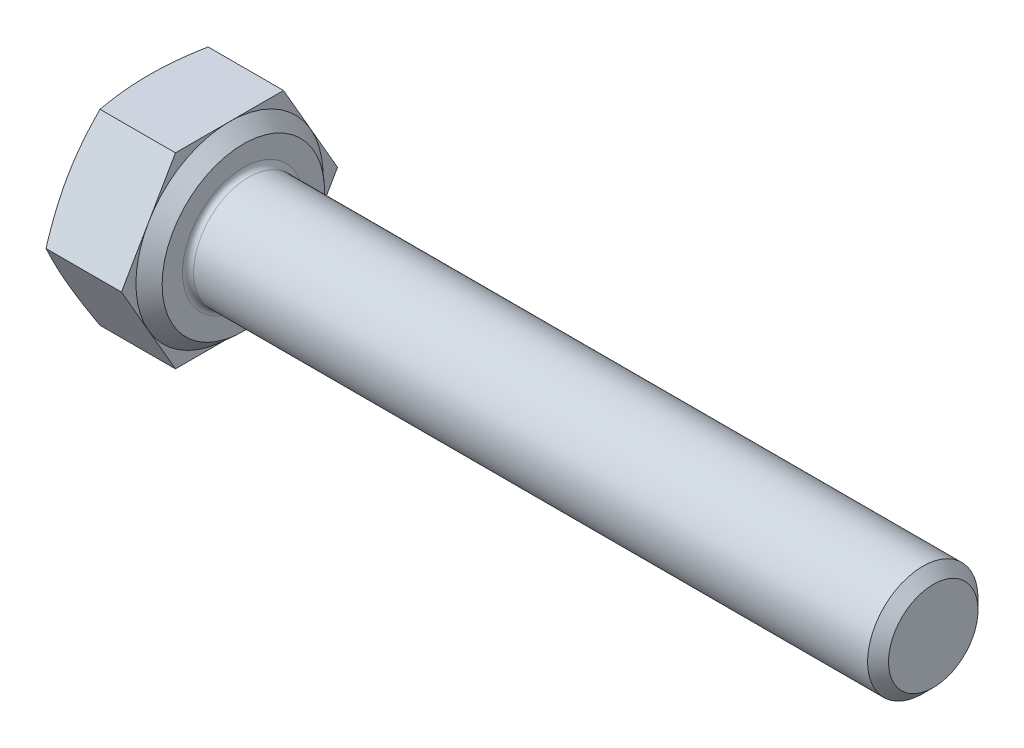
ISO-10303-21;
HEADER;
FILE_DESCRIPTION(('STEP AP214'),'2;1');
FILE_NAME('part.step','',(''),(''),'','','');
FILE_SCHEMA(('AUTOMOTIVE_DESIGN { 1 0 10303 214 1 1 1 1 }'));
ENDSEC;
DATA;
#1=APPLICATION_CONTEXT('core data for automotive mechanical design processes');
#2=APPLICATION_PROTOCOL_DEFINITION('international standard','automotive_design',2000,#1);
#3=PRODUCT_CONTEXT('',#1,'mechanical');
#4=PRODUCT('Part','Part','',(#3));
#5=PRODUCT_RELATED_PRODUCT_CATEGORY('part','',(#4));
#6=PRODUCT_DEFINITION_FORMATION('','',#4);
#7=PRODUCT_DEFINITION_CONTEXT('part definition',#1,'design');
#8=PRODUCT_DEFINITION('design','',#6,#7);
#9=PRODUCT_DEFINITION_SHAPE('','',#8);
#10=(LENGTH_UNIT() NAMED_UNIT(*) SI_UNIT(.MILLI.,.METRE.));
#11=(NAMED_UNIT(*) PLANE_ANGLE_UNIT() SI_UNIT($,.RADIAN.));
#12=(NAMED_UNIT(*) SI_UNIT($,.STERADIAN.) SOLID_ANGLE_UNIT());
#13=UNCERTAINTY_MEASURE_WITH_UNIT(LENGTH_MEASURE(1.E-05),#10,'distance_accuracy_value','');
#14=(GEOMETRIC_REPRESENTATION_CONTEXT(3) GLOBAL_UNCERTAINTY_ASSIGNED_CONTEXT((#13)) GLOBAL_UNIT_ASSIGNED_CONTEXT((#10,
#11,#12)) REPRESENTATION_CONTEXT('',''));
#15=CARTESIAN_POINT('',(0.,0.,0.));
#16=DIRECTION('',(0.,0.,1.));
#17=DIRECTION('',(1.,0.,0.));
#18=AXIS2_PLACEMENT_3D('',#15,#16,#17);
#19=CARTESIAN_POINT('',(3.425,0.,0.));
#20=DIRECTION('',(1.,0.,0.));
#21=DIRECTION('',(0.,0.,-1.));
#22=AXIS2_PLACEMENT_3D('',#19,#20,#21);
#23=PLANE('',#22);
#24=CARTESIAN_POINT('',(3.425,0.,0.));
#25=DIRECTION('',(1.,0.,0.));
#26=DIRECTION('',(0.,0.,-1.));
#27=AXIS2_PLACEMENT_3D('',#24,#25,#26);
#28=CIRCLE('',#27,2.2);
#29=CARTESIAN_POINT('',(3.425,0.,-2.2));
#30=VERTEX_POINT('',#29);
#31=EDGE_CURVE('E188',#30,#30,#28,.F.);
#32=ORIENTED_EDGE('',*,*,#31,.T.);
#33=EDGE_LOOP('',(#32));
#34=FACE_BOUND('',#33,.T.);
#35=CARTESIAN_POINT('',(3.425,0.,0.));
#36=DIRECTION('',(-1.,0.,0.));
#37=DIRECTION('',(0.,0.,1.));
#38=AXIS2_PLACEMENT_3D('',#35,#36,#37);
#39=CIRCLE('',#38,2.94);
#40=CARTESIAN_POINT('',(3.425,0.,2.94));
#41=VERTEX_POINT('',#40);
#42=EDGE_CURVE('E139',#41,#41,#39,.T.);
#43=ORIENTED_EDGE('',*,*,#42,.F.);
#44=EDGE_LOOP('',(#43));
#45=FACE_BOUND('',#44,.T.);
#46=ADVANCED_FACE('F33',(#34,#45),#23,.T.);
#47=CARTESIAN_POINT('',(2.925,0.,-3.91443482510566));
#48=DIRECTION('',(1.,0.,0.));
#49=DIRECTION('',(0.,0.,-1.));
#50=AXIS2_PLACEMENT_3D('',#47,#48,#49);
#51=PLANE('',#50);
#52=DIRECTION('',(0.,-0.866025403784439,0.5));
#53=VECTOR('',#52,1.);
#54=CARTESIAN_POINT('',(2.925,3.39,1.95721741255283));
#55=LINE('',#54,#53);
#56=CARTESIAN_POINT('',(2.925,3.39,1.95721741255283));
#57=VERTEX_POINT('',#56);
#58=CARTESIAN_POINT('',(2.925,1.695,2.93582611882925));
#59=VERTEX_POINT('',#58);
#60=EDGE_CURVE('E138',#57,#59,#55,.T.);
#61=ORIENTED_EDGE('',*,*,#60,.T.);
#62=CARTESIAN_POINT('',(2.925,0.,0.));
#63=DIRECTION('',(-1.,0.,0.));
#64=DIRECTION('',(0.,0.,1.));
#65=AXIS2_PLACEMENT_3D('',#62,#63,#64);
#66=CIRCLE('',#65,3.39);
#67=CARTESIAN_POINT('',(2.925,3.39,0.));
#68=VERTEX_POINT('',#67);
#69=EDGE_CURVE('E49',#59,#68,#66,.T.);
#70=ORIENTED_EDGE('',*,*,#69,.T.);
#71=DIRECTION('',(0.,0.,1.));
#72=VECTOR('',#71,1.);
#73=CARTESIAN_POINT('',(2.925,3.39,-1.95721741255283));
#74=LINE('',#73,#72);
#75=EDGE_CURVE('E135',#68,#57,#74,.T.);
#76=ORIENTED_EDGE('',*,*,#75,.T.);
#77=EDGE_LOOP('',(#61,#70,#76));
#78=FACE_BOUND('',#77,.T.);
#79=ADVANCED_FACE('F134',(#78),#51,.T.);
#80=CARTESIAN_POINT('',(2.925,3.39,-1.95721741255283));
#81=VERTEX_POINT('',#80);
#82=EDGE_CURVE('E145',#81,#68,#74,.T.);
#83=ORIENTED_EDGE('',*,*,#82,.T.);
#84=CARTESIAN_POINT('',(2.925,1.695,-2.93582611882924));
#85=VERTEX_POINT('',#84);
#86=EDGE_CURVE('E122',#68,#85,#66,.T.);
#87=ORIENTED_EDGE('',*,*,#86,.T.);
#88=DIRECTION('',(0.,0.866025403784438,0.5));
#89=VECTOR('',#88,1.);
#90=CARTESIAN_POINT('',(2.925,0.,-3.91443482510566));
#91=LINE('',#90,#89);
#92=EDGE_CURVE('E151',#85,#81,#91,.T.);
#93=ORIENTED_EDGE('',*,*,#92,.T.);
#94=EDGE_LOOP('',(#83,#87,#93));
#95=FACE_BOUND('',#94,.T.);
#96=ADVANCED_FACE('F150',(#95),#51,.T.);
#97=CARTESIAN_POINT('',(2.925,0.,-3.91443482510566));
#98=VERTEX_POINT('',#97);
#99=EDGE_CURVE('E148',#98,#85,#91,.T.);
#100=ORIENTED_EDGE('',*,*,#99,.T.);
#101=CARTESIAN_POINT('',(2.925,-1.695,-2.93582611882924));
#102=VERTEX_POINT('',#101);
#103=EDGE_CURVE('E125',#85,#102,#66,.T.);
#104=ORIENTED_EDGE('',*,*,#103,.T.);
#105=DIRECTION('',(0.,0.866025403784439,-0.5));
#106=VECTOR('',#105,1.);
#107=CARTESIAN_POINT('',(2.925,-3.39,-1.95721741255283));
#108=LINE('',#107,#106);
#109=EDGE_CURVE('E306',#102,#98,#108,.T.);
#110=ORIENTED_EDGE('',*,*,#109,.T.);
#111=EDGE_LOOP('',(#100,#104,#110));
#112=FACE_BOUND('',#111,.T.);
#113=ADVANCED_FACE('F337',(#112),#51,.T.);
#114=CARTESIAN_POINT('',(2.925,-3.39,-1.95721741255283));
#115=VERTEX_POINT('',#114);
#116=EDGE_CURVE('E304',#115,#102,#108,.T.);
#117=ORIENTED_EDGE('',*,*,#116,.T.);
#118=CARTESIAN_POINT('',(2.925,-3.39,0.));
#119=VERTEX_POINT('',#118);
#120=EDGE_CURVE('E338',#102,#119,#66,.T.);
#121=ORIENTED_EDGE('',*,*,#120,.T.);
#122=DIRECTION('',(0.,0.,-1.));
#123=VECTOR('',#122,1.);
#124=CARTESIAN_POINT('',(2.925,-3.39,1.95721741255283));
#125=LINE('',#124,#123);
#126=EDGE_CURVE('E162',#119,#115,#125,.T.);
#127=ORIENTED_EDGE('',*,*,#126,.T.);
#128=EDGE_LOOP('',(#117,#121,#127));
#129=FACE_BOUND('',#128,.T.);
#130=ADVANCED_FACE('F352',(#129),#51,.T.);
#131=CARTESIAN_POINT('',(2.925,-3.39,1.95721741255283));
#132=VERTEX_POINT('',#131);
#133=EDGE_CURVE('E163',#132,#119,#125,.T.);
#134=ORIENTED_EDGE('',*,*,#133,.T.);
#135=CARTESIAN_POINT('',(2.925,-1.695,2.93582611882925));
#136=VERTEX_POINT('',#135);
#137=EDGE_CURVE('E339',#119,#136,#66,.T.);
#138=ORIENTED_EDGE('',*,*,#137,.T.);
#139=DIRECTION('',(0.,-0.866025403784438,-0.5));
#140=VECTOR('',#139,1.);
#141=CARTESIAN_POINT('',(2.925,0.,3.91443482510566));
#142=LINE('',#141,#140);
#143=EDGE_CURVE('E158',#136,#132,#142,.T.);
#144=ORIENTED_EDGE('',*,*,#143,.T.);
#145=EDGE_LOOP('',(#134,#138,#144));
#146=FACE_BOUND('',#145,.T.);
#147=ADVANCED_FACE('F347',(#146),#51,.T.);
#148=CARTESIAN_POINT('',(2.925,0.,3.91443482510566));
#149=VERTEX_POINT('',#148);
#150=EDGE_CURVE('E159',#149,#136,#142,.T.);
#151=ORIENTED_EDGE('',*,*,#150,.T.);
#152=EDGE_CURVE('E140',#136,#59,#66,.T.);
#153=ORIENTED_EDGE('',*,*,#152,.T.);
#154=EDGE_CURVE('E153',#59,#149,#55,.T.);
#155=ORIENTED_EDGE('',*,*,#154,.T.);
#156=EDGE_LOOP('',(#151,#153,#155));
#157=FACE_BOUND('',#156,.T.);
#158=ADVANCED_FACE('F213',(#157),#51,.T.);
#159=CARTESIAN_POINT('',(2.925,-3.39,-1.95721741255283));
#160=DIRECTION('',(0.,0.5,0.866025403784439));
#161=DIRECTION('',(0.,-0.866025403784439,0.5));
#162=AXIS2_PLACEMENT_3D('',#159,#160,#161);
#163=PLANE('',#162);
#164=CARTESIAN_POINT('',(0.190920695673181,0.000199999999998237,-3.9145502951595));
#165=CARTESIAN_POINT('',(0.161404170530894,-0.140203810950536,-3.83348811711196));
#166=CARTESIAN_POINT('',(0.134553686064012,-0.281070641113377,-3.75215861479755));
#167=CARTESIAN_POINT('',(0.0873142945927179,-0.563720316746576,-3.58897074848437));
#168=CARTESIAN_POINT('',(0.0669304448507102,-0.705503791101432,-3.50711202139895));
#169=CARTESIAN_POINT('',(0.0339601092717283,-0.98841313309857,-3.34377423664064));
#170=CARTESIAN_POINT('',(0.0213017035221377,-1.12953253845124,-3.2622989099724));
#171=CARTESIAN_POINT('',(0.00432321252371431,-1.41210139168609,-3.09915770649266));
#172=CARTESIAN_POINT('',(0.,-1.55355069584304,-3.01749191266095));
#173=CARTESIAN_POINT('',(0.,-1.83644930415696,-2.85416032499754));
#174=CARTESIAN_POINT('',(0.00432321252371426,-1.97789860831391,-2.77249453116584));
#175=CARTESIAN_POINT('',(0.0213017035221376,-2.26046746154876,-2.6093533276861));
#176=CARTESIAN_POINT('',(0.0339601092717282,-2.40158686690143,-2.52787800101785));
#177=CARTESIAN_POINT('',(0.06693044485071,-2.68449620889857,-2.36454021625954));
#178=CARTESIAN_POINT('',(0.0873142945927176,-2.82627968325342,-2.28268148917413));
#179=CARTESIAN_POINT('',(0.134553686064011,-3.10892935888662,-2.11949362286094));
#180=CARTESIAN_POINT('',(0.161404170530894,-3.24979618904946,-2.03816412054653));
#181=CARTESIAN_POINT('',(0.190920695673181,-3.3902,-1.95710194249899));
#182=B_SPLINE_CURVE_WITH_KNOTS('',3,(#164,#165,#166,#167,#168,#169,#170,#171,#172,#173,#174,
#175,#176,#177,#178,#179,#180,#181),.UNSPECIFIED.,.F.,.F.,(4,2,2,2,2,2,2,2,4),(0.,
0.494419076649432,0.989223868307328,1.47934907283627,1.96929035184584,2.45923163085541,
2.94935683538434,3.44416162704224,3.93858070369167),.UNSPECIFIED.);
#183=CARTESIAN_POINT('',(0.190878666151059,0.,-3.91443482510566));
#184=VERTEX_POINT('',#183);
#185=CARTESIAN_POINT('',(0.,-1.695,-2.93582611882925));
#186=VERTEX_POINT('',#185);
#187=EDGE_CURVE('E321',#184,#186,#182,.T.);
#188=ORIENTED_EDGE('',*,*,#187,.F.);
#189=DIRECTION('',(-1.,0.,0.));
#190=VECTOR('',#189,1.);
#191=CARTESIAN_POINT('',(2.925,0.,-3.91443482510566));
#192=LINE('',#191,#190);
#193=EDGE_CURVE('E178',#98,#184,#192,.T.);
#194=ORIENTED_EDGE('',*,*,#193,.F.);
#195=ORIENTED_EDGE('',*,*,#109,.F.);
#196=ORIENTED_EDGE('',*,*,#116,.F.);
#197=DIRECTION('',(-1.,0.,0.));
#198=VECTOR('',#197,1.);
#199=CARTESIAN_POINT('',(2.925,-3.39,-1.95721741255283));
#200=LINE('',#199,#198);
#201=CARTESIAN_POINT('',(0.190878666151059,-3.39,-1.95721741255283));
#202=VERTEX_POINT('',#201);
#203=EDGE_CURVE('E166',#115,#202,#200,.T.);
#204=ORIENTED_EDGE('',*,*,#203,.T.);
#205=EDGE_CURVE('E246',#186,#202,#182,.T.);
#206=ORIENTED_EDGE('',*,*,#205,.F.);
#207=EDGE_LOOP('',(#188,#194,#195,#196,#204,#206));
#208=FACE_BOUND('',#207,.T.);
#209=ADVANCED_FACE('F35',(#208),#163,.F.);
#210=CARTESIAN_POINT('',(2.925,0.,-3.91443482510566));
#211=DIRECTION('',(0.,-0.5,0.866025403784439));
#212=DIRECTION('',(0.,-0.866025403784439,-0.5));
#213=AXIS2_PLACEMENT_3D('',#210,#211,#212);
#214=PLANE('',#213);
#215=CARTESIAN_POINT('',(0.190920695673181,3.3902,-1.95710194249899));
#216=CARTESIAN_POINT('',(0.161404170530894,3.24979618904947,-2.03816412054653));
#217=CARTESIAN_POINT('',(0.134553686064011,3.10892935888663,-2.11949362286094));
#218=CARTESIAN_POINT('',(0.0873142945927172,2.82627968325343,-2.28268148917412));
#219=CARTESIAN_POINT('',(0.0669304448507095,2.68449620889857,-2.36454021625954));
#220=CARTESIAN_POINT('',(0.0339601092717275,2.40158686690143,-2.52787800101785));
#221=CARTESIAN_POINT('',(0.0213017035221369,2.26046746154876,-2.60935332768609));
#222=CARTESIAN_POINT('',(0.00432321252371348,1.97789860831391,-2.77249453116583));
#223=CARTESIAN_POINT('',(0.,1.83644930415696,-2.85416032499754));
#224=CARTESIAN_POINT('',(0.,1.55355069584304,-3.01749191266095));
#225=CARTESIAN_POINT('',(0.00432321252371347,1.41210139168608,-3.09915770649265));
#226=CARTESIAN_POINT('',(0.021301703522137,1.12953253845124,-3.2622989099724));
#227=CARTESIAN_POINT('',(0.0339601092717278,0.988413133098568,-3.34377423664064));
#228=CARTESIAN_POINT('',(0.0669304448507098,0.705503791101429,-3.50711202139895));
#229=CARTESIAN_POINT('',(0.0873142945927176,0.563720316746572,-3.58897074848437));
#230=CARTESIAN_POINT('',(0.134553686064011,0.281070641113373,-3.75215861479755));
#231=CARTESIAN_POINT('',(0.161404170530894,0.140203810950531,-3.83348811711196));
#232=CARTESIAN_POINT('',(0.190920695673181,-0.000200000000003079,-3.9145502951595));
#233=B_SPLINE_CURVE_WITH_KNOTS('',3,(#215,#216,#217,#218,#219,#220,#221,#222,#223,#224,#225,
#226,#227,#228,#229,#230,#231,#232),.UNSPECIFIED.,.F.,.F.,(4,2,2,2,2,2,2,2,4),(0.,
0.494419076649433,0.989223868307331,1.47934907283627,1.96929035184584,2.45923163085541,
2.94935683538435,3.44416162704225,3.93858070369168),.UNSPECIFIED.);
#234=CARTESIAN_POINT('',(0.190878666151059,3.39,-1.95721741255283));
#235=VERTEX_POINT('',#234);
#236=CARTESIAN_POINT('',(0.,1.695,-2.93582611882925));
#237=VERTEX_POINT('',#236);
#238=EDGE_CURVE('E261',#235,#237,#233,.T.);
#239=ORIENTED_EDGE('',*,*,#238,.F.);
#240=DIRECTION('',(-1.,0.,0.));
#241=VECTOR('',#240,1.);
#242=CARTESIAN_POINT('',(2.925,3.39,-1.95721741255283));
#243=LINE('',#242,#241);
#244=EDGE_CURVE('E176',#81,#235,#243,.T.);
#245=ORIENTED_EDGE('',*,*,#244,.F.);
#246=ORIENTED_EDGE('',*,*,#92,.F.);
#247=ORIENTED_EDGE('',*,*,#99,.F.);
#248=ORIENTED_EDGE('',*,*,#193,.T.);
#249=EDGE_CURVE('E257',#237,#184,#233,.T.);
#250=ORIENTED_EDGE('',*,*,#249,.F.);
#251=EDGE_LOOP('',(#239,#245,#246,#247,#248,#250));
#252=FACE_BOUND('',#251,.T.);
#253=ADVANCED_FACE('F267',(#252),#214,.F.);
#254=CARTESIAN_POINT('',(2.925,3.39,-1.95721741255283));
#255=DIRECTION('',(0.,-1.,0.));
#256=DIRECTION('',(0.,0.,-1.));
#257=AXIS2_PLACEMENT_3D('',#254,#255,#256);
#258=PLANE('',#257);
#259=CARTESIAN_POINT('',(1.01998007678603,3.39,-5.18202410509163));
#260=CARTESIAN_POINT('',(0.973277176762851,3.39,-5.02864822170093));
#261=CARTESIAN_POINT('',(0.927119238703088,3.39,-4.87510331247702));
#262=CARTESIAN_POINT('',(0.836194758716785,3.39,-4.56758939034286));
#263=CARTESIAN_POINT('',(0.79142832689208,3.39,-4.41362034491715));
#264=CARTESIAN_POINT('',(0.703513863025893,3.39,-4.10490856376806));
#265=CARTESIAN_POINT('',(0.660369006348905,3.39,-3.95016492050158));
#266=CARTESIAN_POINT('',(0.57620280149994,3.39,-3.64010200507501));
#267=CARTESIAN_POINT('',(0.535181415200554,3.39,-3.48478274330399));
#268=CARTESIAN_POINT('',(0.456277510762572,3.39,-3.17538445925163));
#269=CARTESIAN_POINT('',(0.418362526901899,3.39,-3.02131375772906));
#270=CARTESIAN_POINT('',(0.345760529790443,3.39,-2.71240553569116));
#271=CARTESIAN_POINT('',(0.311073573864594,3.39,-2.55756800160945));
#272=CARTESIAN_POINT('',(0.245736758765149,3.39,-2.24709346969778));
#273=CARTESIAN_POINT('',(0.215085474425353,3.39,-2.09145677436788));
#274=CARTESIAN_POINT('',(0.158752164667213,3.39,-1.77927622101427));
#275=CARTESIAN_POINT('',(0.133070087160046,3.39,-1.62273237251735));
#276=CARTESIAN_POINT('',(0.0902615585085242,3.39,-1.32636324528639));
#277=CARTESIAN_POINT('',(0.0724987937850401,3.39,-1.18663074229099));
#278=CARTESIAN_POINT('',(0.0424324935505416,3.39,-0.906588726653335));
#279=CARTESIAN_POINT('',(0.030128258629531,3.39,-0.76627929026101));
#280=CARTESIAN_POINT('',(0.0115684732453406,3.39,-0.485347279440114));
#281=CARTESIAN_POINT('',(0.00530894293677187,3.39,-0.344724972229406));
#282=CARTESIAN_POINT('',(-0.000843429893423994,3.39,-0.0633396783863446));
#283=CARTESIAN_POINT('',(-0.000736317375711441,3.39,0.0774233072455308));
#284=CARTESIAN_POINT('',(0.00585535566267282,3.39,0.359511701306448));
#285=CARTESIAN_POINT('',(0.0123722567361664,3.39,0.500836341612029));
#286=CARTESIAN_POINT('',(0.0314839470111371,3.39,0.783070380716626));
#287=CARTESIAN_POINT('',(0.0440788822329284,3.39,0.923979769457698));
#288=CARTESIAN_POINT('',(0.0747561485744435,3.39,1.20531436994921));
#289=CARTESIAN_POINT('',(0.0928431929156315,3.39,1.345739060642));
#290=CARTESIAN_POINT('',(0.133775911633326,3.39,1.62588403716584));
#291=CARTESIAN_POINT('',(0.156621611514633,3.39,1.76560431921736));
#292=CARTESIAN_POINT('',(0.233780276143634,3.39,2.19842514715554));
#293=CARTESIAN_POINT('',(0.294955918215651,3.39,2.49029882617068));
#294=CARTESIAN_POINT('',(0.429080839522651,3.39,3.07133562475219));
#295=CARTESIAN_POINT('',(0.502034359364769,3.39,3.36049772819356));
#296=CARTESIAN_POINT('',(0.655790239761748,3.39,3.93710818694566));
#297=CARTESIAN_POINT('',(0.736602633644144,3.39,4.22455384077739));
#298=CARTESIAN_POINT('',(0.903426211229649,3.39,4.79786777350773));
#299=CARTESIAN_POINT('',(0.989436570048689,3.39,5.08373629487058));
#300=CARTESIAN_POINT('',(1.16408502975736,3.39,5.6512119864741));
#301=CARTESIAN_POINT('',(1.25268364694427,3.39,5.93283136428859));
#302=CARTESIAN_POINT('',(1.43239750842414,3.39,6.4952782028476));
#303=CARTESIAN_POINT('',(1.52351287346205,3.39,6.77610562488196));
#304=CARTESIAN_POINT('',(1.7072288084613,3.39,7.33609271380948));
#305=CARTESIAN_POINT('',(1.79982243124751,3.39,7.61525466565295));
#306=CARTESIAN_POINT('',(1.98639796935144,3.39,8.17308908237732));
#307=CARTESIAN_POINT('',(2.08037976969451,3.39,8.45176158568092));
#308=CARTESIAN_POINT('',(2.17484722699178,3.39,8.7302669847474));
#309=B_SPLINE_CURVE_WITH_KNOTS('',3,(#259,#260,#261,#262,#263,#264,#265,#266,#267,#268,#269,
#270,#271,#272,#273,#274,#275,#276,#277,#278,#279,#280,#281,#282,#283,#284,#285,#286,#287,#288,
#289,#290,#291,#292,#293,#294,#295,#296,#297,#298,#299,#300,#301,#302,#303,#304,#305,#306,#307,
#308),.UNSPECIFIED.,.F.,.F.,(4,2,2,2,2,2,2,2,2,2,2,2,2,2,2,2,2,2,2,2,2,2,2,2,4),(0.,
0.480989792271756,0.962017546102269,1.44394277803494,1.92585935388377,2.40183391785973,
2.87781693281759,3.35363140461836,3.82944088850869,4.25191903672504,4.6743430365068,
5.09648872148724,5.5186314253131,5.94291503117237,6.36720883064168,6.79186778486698,
7.21652901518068,8.11074158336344,9.00527683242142,9.90096950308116,10.7965204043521,
11.6821863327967,12.5678948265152,13.4502426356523,14.3325177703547),.UNSPECIFIED.);
#310=CARTESIAN_POINT('',(0.190878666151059,3.39,1.95721741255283));
#311=VERTEX_POINT('',#310);
#312=CARTESIAN_POINT('',(0.,3.39,0.));
#313=VERTEX_POINT('',#312);
#314=EDGE_CURVE('E57',#311,#313,#309,.F.);
#315=ORIENTED_EDGE('',*,*,#314,.F.);
#316=DIRECTION('',(-1.,0.,0.));
#317=VECTOR('',#316,1.);
#318=CARTESIAN_POINT('',(2.925,3.39,1.95721741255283));
#319=LINE('',#318,#317);
#320=EDGE_CURVE('E147',#57,#311,#319,.T.);
#321=ORIENTED_EDGE('',*,*,#320,.F.);
#322=ORIENTED_EDGE('',*,*,#75,.F.);
#323=ORIENTED_EDGE('',*,*,#82,.F.);
#324=ORIENTED_EDGE('',*,*,#244,.T.);
#325=EDGE_CURVE('E262',#313,#235,#309,.F.);
#326=ORIENTED_EDGE('',*,*,#325,.F.);
#327=EDGE_LOOP('',(#315,#321,#322,#323,#324,#326));
#328=FACE_BOUND('',#327,.T.);
#329=ADVANCED_FACE('F143',(#328),#258,.F.);
#330=CARTESIAN_POINT('',(2.925,3.39,1.95721741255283));
#331=DIRECTION('',(0.,-0.5,-0.866025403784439));
#332=DIRECTION('',(0.,0.866025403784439,-0.5));
#333=AXIS2_PLACEMENT_3D('',#330,#331,#332);
#334=PLANE('',#333);
#335=CARTESIAN_POINT('',(0.190920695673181,-0.000199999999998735,3.9145502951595));
#336=CARTESIAN_POINT('',(0.161404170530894,0.140203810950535,3.83348811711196));
#337=CARTESIAN_POINT('',(0.134553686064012,0.281070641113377,3.75215861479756));
#338=CARTESIAN_POINT('',(0.0873142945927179,0.563720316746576,3.58897074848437));
#339=CARTESIAN_POINT('',(0.0669304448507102,0.705503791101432,3.50711202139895));
#340=CARTESIAN_POINT('',(0.0339601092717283,0.988413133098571,3.34377423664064));
#341=CARTESIAN_POINT('',(0.0213017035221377,1.12953253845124,3.2622989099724));
#342=CARTESIAN_POINT('',(0.0043232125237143,1.41210139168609,3.09915770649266));
#343=CARTESIAN_POINT('',(0.,1.55355069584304,3.01749191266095));
#344=CARTESIAN_POINT('',(0.,1.83644930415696,2.85416032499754));
#345=CARTESIAN_POINT('',(0.00432321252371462,1.97789860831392,2.77249453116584));
#346=CARTESIAN_POINT('',(0.0213017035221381,2.26046746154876,2.6093533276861));
#347=CARTESIAN_POINT('',(0.0339601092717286,2.40158686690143,2.52787800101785));
#348=CARTESIAN_POINT('',(0.0669304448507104,2.68449620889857,2.36454021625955));
#349=CARTESIAN_POINT('',(0.0873142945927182,2.82627968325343,2.28268148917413));
#350=CARTESIAN_POINT('',(0.134553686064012,3.10892935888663,2.11949362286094));
#351=CARTESIAN_POINT('',(0.161404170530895,3.24979618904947,2.03816412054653));
#352=CARTESIAN_POINT('',(0.190920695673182,3.3902,1.95710194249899));
#353=B_SPLINE_CURVE_WITH_KNOTS('',3,(#335,#336,#337,#338,#339,#340,#341,#342,#343,#344,#345,
#346,#347,#348,#349,#350,#351,#352),.UNSPECIFIED.,.F.,.F.,(4,2,2,2,2,2,2,2,4),(0.,
0.494419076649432,0.98922386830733,1.47934907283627,1.96929035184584,2.45923163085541,
2.94935683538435,3.44416162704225,3.93858070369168),.UNSPECIFIED.);
#354=CARTESIAN_POINT('',(0.190878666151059,0.,3.91443482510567));
#355=VERTEX_POINT('',#354);
#356=CARTESIAN_POINT('',(0.,1.695,2.93582611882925));
#357=VERTEX_POINT('',#356);
#358=EDGE_CURVE('E251',#355,#357,#353,.T.);
#359=ORIENTED_EDGE('',*,*,#358,.F.);
#360=DIRECTION('',(-1.,0.,0.));
#361=VECTOR('',#360,1.);
#362=CARTESIAN_POINT('',(2.925,0.,3.91443482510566));
#363=LINE('',#362,#361);
#364=EDGE_CURVE('E172',#149,#355,#363,.T.);
#365=ORIENTED_EDGE('',*,*,#364,.F.);
#366=ORIENTED_EDGE('',*,*,#154,.F.);
#367=ORIENTED_EDGE('',*,*,#60,.F.);
#368=ORIENTED_EDGE('',*,*,#320,.T.);
#369=EDGE_CURVE('E312',#357,#311,#353,.T.);
#370=ORIENTED_EDGE('',*,*,#369,.F.);
#371=EDGE_LOOP('',(#359,#365,#366,#367,#368,#370));
#372=FACE_BOUND('',#371,.T.);
#373=ADVANCED_FACE('F273',(#372),#334,.F.);
#374=CARTESIAN_POINT('',(2.925,0.,3.91443482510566));
#375=DIRECTION('',(0.,0.5,-0.866025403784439));
#376=DIRECTION('',(0.,0.866025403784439,0.5));
#377=AXIS2_PLACEMENT_3D('',#374,#375,#376);
#378=PLANE('',#377);
#379=CARTESIAN_POINT('',(0.190920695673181,-3.3902,1.95710194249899));
#380=CARTESIAN_POINT('',(0.161404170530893,-3.24979618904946,2.03816412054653));
#381=CARTESIAN_POINT('',(0.134553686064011,-3.10892935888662,2.11949362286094));
#382=CARTESIAN_POINT('',(0.0873142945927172,-2.82627968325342,2.28268148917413));
#383=CARTESIAN_POINT('',(0.0669304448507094,-2.68449620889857,2.36454021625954));
#384=CARTESIAN_POINT('',(0.0339601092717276,-2.40158686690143,2.52787800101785));
#385=CARTESIAN_POINT('',(0.0213017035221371,-2.26046746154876,2.6093533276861));
#386=CARTESIAN_POINT('',(0.00432321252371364,-1.97789860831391,2.77249453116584));
#387=CARTESIAN_POINT('',(0.,-1.83644930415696,2.85416032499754));
#388=CARTESIAN_POINT('',(0.,-1.55355069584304,3.01749191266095));
#389=CARTESIAN_POINT('',(0.00432321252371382,-1.41210139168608,3.09915770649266));
#390=CARTESIAN_POINT('',(0.0213017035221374,-1.12953253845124,3.2622989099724));
#391=CARTESIAN_POINT('',(0.033960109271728,-0.988413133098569,3.34377423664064));
#392=CARTESIAN_POINT('',(0.06693044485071,-0.70550379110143,3.50711202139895));
#393=CARTESIAN_POINT('',(0.0873142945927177,-0.563720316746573,3.58897074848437));
#394=CARTESIAN_POINT('',(0.134553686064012,-0.281070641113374,3.75215861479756));
#395=CARTESIAN_POINT('',(0.161404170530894,-0.140203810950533,3.83348811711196));
#396=CARTESIAN_POINT('',(0.190920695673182,0.000200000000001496,3.9145502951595));
#397=B_SPLINE_CURVE_WITH_KNOTS('',3,(#379,#380,#381,#382,#383,#384,#385,#386,#387,#388,#389,
#390,#391,#392,#393,#394,#395,#396),.UNSPECIFIED.,.F.,.F.,(4,2,2,2,2,2,2,2,4),(0.,
0.494419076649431,0.989223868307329,1.47934907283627,1.96929035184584,2.45923163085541,
2.94935683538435,3.44416162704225,3.93858070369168),.UNSPECIFIED.);
#398=CARTESIAN_POINT('',(0.190878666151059,-3.39,1.95721741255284));
#399=VERTEX_POINT('',#398);
#400=CARTESIAN_POINT('',(0.,-1.695,2.93582611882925));
#401=VERTEX_POINT('',#400);
#402=EDGE_CURVE('E239',#399,#401,#397,.T.);
#403=ORIENTED_EDGE('',*,*,#402,.F.);
#404=DIRECTION('',(-1.,0.,0.));
#405=VECTOR('',#404,1.);
#406=CARTESIAN_POINT('',(2.925,-3.39,1.95721741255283));
#407=LINE('',#406,#405);
#408=EDGE_CURVE('E169',#132,#399,#407,.T.);
#409=ORIENTED_EDGE('',*,*,#408,.F.);
#410=ORIENTED_EDGE('',*,*,#143,.F.);
#411=ORIENTED_EDGE('',*,*,#150,.F.);
#412=ORIENTED_EDGE('',*,*,#364,.T.);
#413=EDGE_CURVE('E317',#401,#355,#397,.T.);
#414=ORIENTED_EDGE('',*,*,#413,.F.);
#415=EDGE_LOOP('',(#403,#409,#410,#411,#412,#414));
#416=FACE_BOUND('',#415,.T.);
#417=ADVANCED_FACE('F276',(#416),#378,.F.);
#418=CARTESIAN_POINT('',(2.925,-3.39,1.95721741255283));
#419=DIRECTION('',(0.,1.,0.));
#420=DIRECTION('',(0.,0.,1.));
#421=AXIS2_PLACEMENT_3D('',#418,#419,#420);
#422=PLANE('',#421);
#423=CARTESIAN_POINT('',(1.01997989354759,-3.39,-5.18202350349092));
#424=CARTESIAN_POINT('',(0.973277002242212,-3.39,-5.02864764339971));
#425=CARTESIAN_POINT('',(0.927119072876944,-3.39,-4.87510275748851));
#426=CARTESIAN_POINT('',(0.836194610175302,-3.39,-4.56758888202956));
#427=CARTESIAN_POINT('',(0.791428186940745,-3.39,-4.41361985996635));
#428=CARTESIAN_POINT('',(0.703513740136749,-3.39,-4.1049081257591));
#429=CARTESIAN_POINT('',(0.66036889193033,-3.39,-3.95016450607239));
#430=CARTESIAN_POINT('',(0.576202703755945,-3.39,-3.64010163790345));
#431=CARTESIAN_POINT('',(0.535181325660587,-3.39,-3.48478239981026));
#432=CARTESIAN_POINT('',(0.456277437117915,-3.39,-3.17538416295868));
#433=CARTESIAN_POINT('',(0.418362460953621,-3.39,-3.02131348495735));
#434=CARTESIAN_POINT('',(0.345760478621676,-3.39,-2.71240531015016));
#435=CARTESIAN_POINT('',(0.31107352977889,-3.39,-2.55756779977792));
#436=CARTESIAN_POINT('',(0.245736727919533,-3.39,-2.24709331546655));
#437=CARTESIAN_POINT('',(0.215085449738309,-3.39,-2.09145664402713));
#438=CARTESIAN_POINT('',(0.158752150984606,-3.39,-1.7792761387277));
#439=CARTESIAN_POINT('',(0.133070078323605,-3.39,-1.62273231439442));
#440=CARTESIAN_POINT('',(0.0902615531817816,-3.39,-1.32636320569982));
#441=CARTESIAN_POINT('',(0.0724987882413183,-3.39,-1.18663069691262));
#442=CARTESIAN_POINT('',(0.0424324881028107,-3.39,-0.906588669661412));
#443=CARTESIAN_POINT('',(0.0301282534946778,-3.39,-0.766279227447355));
#444=CARTESIAN_POINT('',(0.011568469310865,-3.39,-0.485347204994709));
#445=CARTESIAN_POINT('',(0.00530893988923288,-3.39,-0.344724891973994));
#446=CARTESIAN_POINT('',(-0.000843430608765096,-3.39,-0.0633395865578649));
#447=CARTESIAN_POINT('',(-0.000736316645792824,-3.39,0.0774234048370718));
#448=CARTESIAN_POINT('',(0.00585535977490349,-3.39,0.359511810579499));
#449=CARTESIAN_POINT('',(0.0123722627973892,-3.39,0.50083645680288));
#450=CARTESIAN_POINT('',(0.0314839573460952,-3.39,0.783070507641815));
#451=CARTESIAN_POINT('',(0.0440788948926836,-3.39,0.923979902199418));
#452=CARTESIAN_POINT('',(0.0747561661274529,-3.39,1.20531451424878));
#453=CARTESIAN_POINT('',(0.0928432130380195,-3.39,1.34573921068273));
#454=CARTESIAN_POINT('',(0.133775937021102,-3.39,1.62588419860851));
#455=CARTESIAN_POINT('',(0.156621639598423,-3.39,1.76560448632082));
#456=CARTESIAN_POINT('',(0.23378031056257,-3.39,2.19842531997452));
#457=CARTESIAN_POINT('',(0.294955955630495,-3.39,2.49029899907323));
#458=CARTESIAN_POINT('',(0.429080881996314,-3.39,3.07133579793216));
#459=CARTESIAN_POINT('',(0.502034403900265,-3.39,3.36049790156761));
#460=CARTESIAN_POINT('',(0.655790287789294,-3.39,3.93710836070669));
#461=CARTESIAN_POINT('',(0.736602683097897,-3.39,4.22455401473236));
#462=CARTESIAN_POINT('',(0.903426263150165,-3.39,4.7978679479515));
#463=CARTESIAN_POINT('',(0.989436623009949,-3.39,5.08373646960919));
#464=CARTESIAN_POINT('',(1.16408508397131,-3.39,5.65121216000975));
#465=CARTESIAN_POINT('',(1.25268370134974,-3.39,5.93283153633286));
#466=CARTESIAN_POINT('',(1.43239756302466,-3.39,6.4952783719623));
#467=CARTESIAN_POINT('',(1.52351292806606,-3.39,6.77610579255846));
#468=CARTESIAN_POINT('',(1.70722886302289,-3.39,7.33609287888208));
#469=CARTESIAN_POINT('',(1.79982248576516,-3.39,7.6152548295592));
#470=CARTESIAN_POINT('',(1.98639802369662,-3.39,8.17308924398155));
#471=CARTESIAN_POINT('',(2.08037982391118,-3.39,8.45176174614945));
#472=CARTESIAN_POINT('',(2.17484728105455,-3.39,8.73026714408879));
#473=B_SPLINE_CURVE_WITH_KNOTS('',3,(#423,#424,#425,#426,#427,#428,#429,#430,#431,#432,#433,
#434,#435,#436,#437,#438,#439,#440,#441,#442,#443,#444,#445,#446,#447,#448,#449,#450,#451,#452,
#453,#454,#455,#456,#457,#458,#459,#460,#461,#462,#463,#464,#465,#466,#467,#468,#469,#470,#471,
#472),.UNSPECIFIED.,.F.,.F.,(4,2,2,2,2,2,2,2,2,2,2,2,2,2,2,2,2,2,2,2,2,2,2,2,4),(0.,
0.480989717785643,0.96201739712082,1.44394255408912,1.92585905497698,2.40183354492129,
2.87781648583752,3.35363088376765,3.82944029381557,4.25191845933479,4.6743424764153,
5.09648817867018,5.5186308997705,5.94291452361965,6.3672083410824,6.79186731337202,
7.21652856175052,8.11074113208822,9.00527638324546,9.90096905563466,10.7965199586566,
11.6821858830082,12.5678943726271,13.4502421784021,14.3325173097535),.UNSPECIFIED.);
#474=CARTESIAN_POINT('',(0.,-3.39,0.));
#475=VERTEX_POINT('',#474);
#476=EDGE_CURVE('E295',#202,#475,#473,.T.);
#477=ORIENTED_EDGE('',*,*,#476,.F.);
#478=ORIENTED_EDGE('',*,*,#203,.F.);
#479=ORIENTED_EDGE('',*,*,#126,.F.);
#480=ORIENTED_EDGE('',*,*,#133,.F.);
#481=ORIENTED_EDGE('',*,*,#408,.T.);
#482=EDGE_CURVE('E229',#475,#399,#473,.T.);
#483=ORIENTED_EDGE('',*,*,#482,.F.);
#484=EDGE_LOOP('',(#477,#478,#479,#480,#481,#483));
#485=FACE_BOUND('',#484,.T.);
#486=ADVANCED_FACE('F280',(#485),#422,.F.);
#487=CARTESIAN_POINT('',(0.,0.,0.));
#488=DIRECTION('',(1.,0.,0.));
#489=DIRECTION('',(0.,0.,-1.));
#490=AXIS2_PLACEMENT_3D('',#487,#488,#489);
#491=CONICAL_SURFACE('',#490,3.39,1.22173047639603);
#492=ORIENTED_EDGE('',*,*,#249,.T.);
#493=ORIENTED_EDGE('',*,*,#187,.T.);
#494=CARTESIAN_POINT('',(0.,0.,0.));
#495=DIRECTION('',(1.,0.,0.));
#496=DIRECTION('',(0.,0.,-1.));
#497=AXIS2_PLACEMENT_3D('',#494,#495,#496);
#498=CIRCLE('',#497,3.39);
#499=EDGE_CURVE('E181',#186,#237,#498,.T.);
#500=ORIENTED_EDGE('',*,*,#499,.T.);
#501=EDGE_LOOP('',(#492,#493,#500));
#502=FACE_BOUND('',#501,.T.);
#503=ADVANCED_FACE('F284',(#502),#491,.T.);
#504=ORIENTED_EDGE('',*,*,#205,.T.);
#505=ORIENTED_EDGE('',*,*,#476,.T.);
#506=EDGE_CURVE('E184',#475,#186,#498,.T.);
#507=ORIENTED_EDGE('',*,*,#506,.T.);
#508=EDGE_LOOP('',(#504,#505,#507));
#509=FACE_BOUND('',#508,.T.);
#510=ADVANCED_FACE('F289',(#509),#491,.T.);
#511=ORIENTED_EDGE('',*,*,#402,.T.);
#512=EDGE_CURVE('E330',#401,#475,#498,.T.);
#513=ORIENTED_EDGE('',*,*,#512,.T.);
#514=ORIENTED_EDGE('',*,*,#482,.T.);
#515=EDGE_LOOP('',(#511,#513,#514));
#516=FACE_BOUND('',#515,.T.);
#517=ADVANCED_FACE('F224',(#516),#491,.T.);
#518=ORIENTED_EDGE('',*,*,#358,.T.);
#519=EDGE_CURVE('E336',#357,#401,#498,.T.);
#520=ORIENTED_EDGE('',*,*,#519,.T.);
#521=ORIENTED_EDGE('',*,*,#413,.T.);
#522=EDGE_LOOP('',(#518,#520,#521));
#523=FACE_BOUND('',#522,.T.);
#524=ADVANCED_FACE('F223',(#523),#491,.T.);
#525=ORIENTED_EDGE('',*,*,#314,.T.);
#526=CARTESIAN_POINT('',(0.,0.,0.));
#527=DIRECTION('',(-1.,0.,0.));
#528=DIRECTION('',(0.,0.,1.));
#529=AXIS2_PLACEMENT_3D('',#526,#527,#528);
#530=CIRCLE('',#529,3.39);
#531=EDGE_CURVE('E335',#357,#313,#530,.T.);
#532=ORIENTED_EDGE('',*,*,#531,.F.);
#533=ORIENTED_EDGE('',*,*,#369,.T.);
#534=EDGE_LOOP('',(#525,#532,#533));
#535=FACE_BOUND('',#534,.T.);
#536=ADVANCED_FACE('F218',(#535),#491,.T.);
#537=ORIENTED_EDGE('',*,*,#325,.T.);
#538=ORIENTED_EDGE('',*,*,#238,.T.);
#539=EDGE_CURVE('E185',#237,#313,#498,.T.);
#540=ORIENTED_EDGE('',*,*,#539,.T.);
#541=EDGE_LOOP('',(#537,#538,#540));
#542=FACE_BOUND('',#541,.T.);
#543=ADVANCED_FACE('F222',(#542),#491,.T.);
#544=CARTESIAN_POINT('',(0.,0.,-3.91443482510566));
#545=DIRECTION('',(1.,0.,0.));
#546=DIRECTION('',(0.,0.,-1.));
#547=AXIS2_PLACEMENT_3D('',#544,#545,#546);
#548=PLANE('',#547);
#549=ORIENTED_EDGE('',*,*,#539,.F.);
#550=ORIENTED_EDGE('',*,*,#499,.F.);
#551=ORIENTED_EDGE('',*,*,#506,.F.);
#552=ORIENTED_EDGE('',*,*,#512,.F.);
#553=ORIENTED_EDGE('',*,*,#519,.F.);
#554=ORIENTED_EDGE('',*,*,#531,.T.);
#555=EDGE_LOOP('',(#549,#550,#551,#552,#553,#554));
#556=FACE_BOUND('',#555,.T.);
#557=ADVANCED_FACE('F225',(#556),#548,.F.);
#558=CARTESIAN_POINT('',(2.925,0.,0.));
#559=DIRECTION('',(-1.,0.,0.));
#560=DIRECTION('',(0.,0.,1.));
#561=AXIS2_PLACEMENT_3D('',#558,#559,#560);
#562=CONICAL_SURFACE('',#561,3.39,0.732815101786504);
#563=ORIENTED_EDGE('',*,*,#42,.T.);
#564=EDGE_LOOP('',(#563));
#565=FACE_BOUND('',#564,.T.);
#566=ORIENTED_EDGE('',*,*,#69,.F.);
#567=ORIENTED_EDGE('',*,*,#152,.F.);
#568=ORIENTED_EDGE('',*,*,#137,.F.);
#569=ORIENTED_EDGE('',*,*,#120,.F.);
#570=ORIENTED_EDGE('',*,*,#103,.F.);
#571=ORIENTED_EDGE('',*,*,#86,.F.);
#572=EDGE_LOOP('',(#566,#567,#568,#569,#570,#571));
#573=FACE_BOUND('',#572,.T.);
#574=ADVANCED_FACE('F123',(#565,#573),#562,.T.);
#575=CARTESIAN_POINT('',(28.425,0.,0.));
#576=DIRECTION('',(-1.,0.,0.));
#577=DIRECTION('',(0.,0.,1.));
#578=AXIS2_PLACEMENT_3D('',#575,#576,#577);
#579=CYLINDRICAL_SURFACE('',#578,2.);
#580=CARTESIAN_POINT('',(28.046,0.,0.));
#581=DIRECTION('',(1.,0.,0.));
#582=DIRECTION('',(0.,0.,-1.));
#583=AXIS2_PLACEMENT_3D('',#580,#581,#582);
#584=CIRCLE('',#583,2.);
#585=CARTESIAN_POINT('',(28.046,0.,-2.));
#586=VERTEX_POINT('',#585);
#587=EDGE_CURVE('E12',#586,#586,#584,.F.);
#588=ORIENTED_EDGE('',*,*,#587,.T.);
#589=EDGE_LOOP('',(#588));
#590=FACE_BOUND('',#589,.T.);
#591=CARTESIAN_POINT('',(3.625,0.,0.));
#592=DIRECTION('',(1.,0.,0.));
#593=DIRECTION('',(0.,0.,-1.));
#594=AXIS2_PLACEMENT_3D('',#591,#592,#593);
#595=CIRCLE('',#594,2.);
#596=CARTESIAN_POINT('',(3.625,0.,-2.));
#597=VERTEX_POINT('',#596);
#598=EDGE_CURVE('E129',#597,#597,#595,.T.);
#599=ORIENTED_EDGE('',*,*,#598,.T.);
#600=EDGE_LOOP('',(#599));
#601=FACE_BOUND('',#600,.T.);
#602=ADVANCED_FACE('F454',(#590,#601),#579,.T.);
#603=CARTESIAN_POINT('',(28.425,0.,0.));
#604=DIRECTION('',(1.,0.,0.));
#605=DIRECTION('',(0.,0.,-1.));
#606=AXIS2_PLACEMENT_3D('',#603,#604,#605);
#607=PLANE('',#606);
#608=CARTESIAN_POINT('',(28.425,0.,0.));
#609=DIRECTION('',(1.,0.,0.));
#610=DIRECTION('',(0.,0.,-1.));
#611=AXIS2_PLACEMENT_3D('',#608,#609,#610);
#612=CIRCLE('',#611,1.621);
#613=CARTESIAN_POINT('',(28.425,0.,-1.621));
#614=VERTEX_POINT('',#613);
#615=EDGE_CURVE('E42',#614,#614,#612,.T.);
#616=ORIENTED_EDGE('',*,*,#615,.T.);
#617=EDGE_LOOP('',(#616));
#618=FACE_BOUND('',#617,.T.);
#619=ADVANCED_FACE('F193',(#618),#607,.T.);
#620=CARTESIAN_POINT('',(3.625,0.,0.));
#621=DIRECTION('',(1.,0.,0.));
#622=DIRECTION('',(0.,0.,-1.));
#623=AXIS2_PLACEMENT_3D('',#620,#621,#622);
#624=TOROIDAL_SURFACE('',#623,2.2,0.2);
#625=ORIENTED_EDGE('',*,*,#31,.F.);
#626=EDGE_LOOP('',(#625));
#627=FACE_BOUND('',#626,.T.);
#628=ORIENTED_EDGE('',*,*,#598,.F.);
#629=EDGE_LOOP('',(#628));
#630=FACE_BOUND('',#629,.T.);
#631=ADVANCED_FACE('F197',(#627,#630),#624,.F.);
#632=CARTESIAN_POINT('',(28.425,0.,0.));
#633=DIRECTION('',(-1.,0.,0.));
#634=DIRECTION('',(0.,0.,1.));
#635=AXIS2_PLACEMENT_3D('',#632,#633,#634);
#636=CONICAL_SURFACE('',#635,1.621,0.785398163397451);
#637=ORIENTED_EDGE('',*,*,#587,.F.);
#638=EDGE_LOOP('',(#637));
#639=FACE_BOUND('',#638,.T.);
#640=ORIENTED_EDGE('',*,*,#615,.F.);
#641=EDGE_LOOP('',(#640));
#642=FACE_BOUND('',#641,.T.);
#643=ADVANCED_FACE('F195',(#639,#642),#636,.T.);
#644=CLOSED_SHELL('',(#46,#79,#96,#113,#130,#147,#158,#209,#253,#329,#373,#417,#486,#503,#510,
#517,#524,#536,#543,#557,#574,#602,#619,#631,#643));
#645=MANIFOLD_SOLID_BREP('B2',#644);
#646=ADVANCED_BREP_SHAPE_REPRESENTATION('',(#18,#645),#14);
#647=SHAPE_DEFINITION_REPRESENTATION(#9,#646);
ENDSEC;
END-ISO-10303-21;
